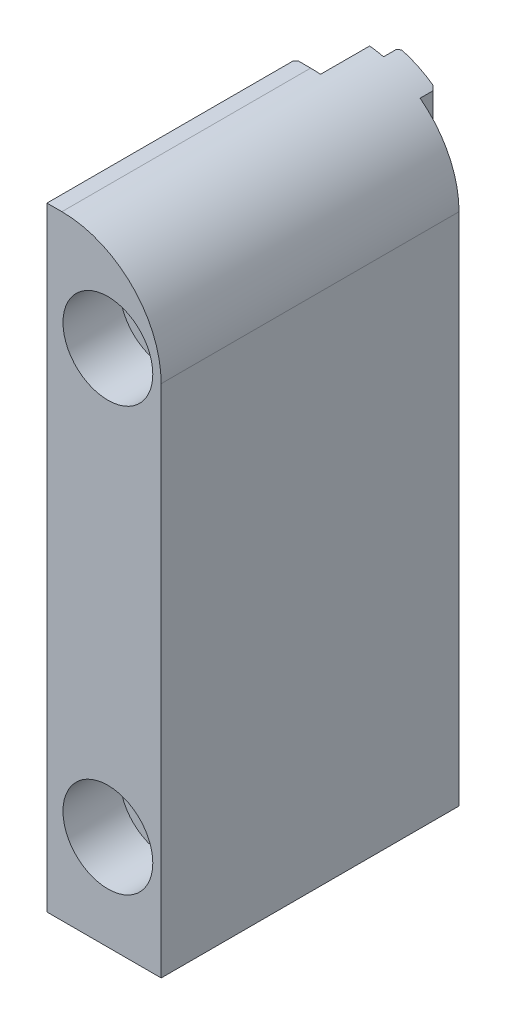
ISO-10303-21;
HEADER;
FILE_DESCRIPTION(('STEP AP214'),'2;1');
FILE_NAME('part.step','',(''),(''),'','','');
FILE_SCHEMA(('AUTOMOTIVE_DESIGN { 1 0 10303 214 1 1 1 1 }'));
ENDSEC;
DATA;
#1=APPLICATION_CONTEXT('core data for automotive mechanical design processes');
#2=APPLICATION_PROTOCOL_DEFINITION('international standard','automotive_design',2000,#1);
#3=PRODUCT_CONTEXT('',#1,'mechanical');
#4=PRODUCT('Part','Part','',(#3));
#5=PRODUCT_RELATED_PRODUCT_CATEGORY('part','',(#4));
#6=PRODUCT_DEFINITION_FORMATION('','',#4);
#7=PRODUCT_DEFINITION_CONTEXT('part definition',#1,'design');
#8=PRODUCT_DEFINITION('design','',#6,#7);
#9=PRODUCT_DEFINITION_SHAPE('','',#8);
#10=(LENGTH_UNIT() NAMED_UNIT(*) SI_UNIT(.MILLI.,.METRE.));
#11=(NAMED_UNIT(*) PLANE_ANGLE_UNIT() SI_UNIT($,.RADIAN.));
#12=(NAMED_UNIT(*) SI_UNIT($,.STERADIAN.) SOLID_ANGLE_UNIT());
#13=UNCERTAINTY_MEASURE_WITH_UNIT(LENGTH_MEASURE(1.E-05),#10,'distance_accuracy_value','');
#14=(GEOMETRIC_REPRESENTATION_CONTEXT(3) GLOBAL_UNCERTAINTY_ASSIGNED_CONTEXT((#13)) GLOBAL_UNIT_ASSIGNED_CONTEXT((#10,
#11,#12)) REPRESENTATION_CONTEXT('',''));
#15=CARTESIAN_POINT('',(0.,0.,0.));
#16=DIRECTION('',(0.,0.,1.));
#17=DIRECTION('',(1.,0.,0.));
#18=AXIS2_PLACEMENT_3D('',#15,#16,#17);
#19=CARTESIAN_POINT('',(7.32028,29.845,-28.956));
#20=DIRECTION('',(0.,0.,-1.));
#21=DIRECTION('',(-1.,0.,0.));
#22=AXIS2_PLACEMENT_3D('',#19,#20,#21);
#23=PLANE('',#22);
#24=CARTESIAN_POINT('',(5.92328,-20.574,-28.956));
#25=DIRECTION('',(0.,0.,1.));
#26=DIRECTION('',(1.,0.,0.));
#27=AXIS2_PLACEMENT_3D('',#24,#25,#26);
#28=CIRCLE('',#27,2.7051);
#29=CARTESIAN_POINT('',(8.62838,-20.574,-28.956));
#30=VERTEX_POINT('',#29);
#31=EDGE_CURVE('E307',#30,#30,#28,.T.);
#32=ORIENTED_EDGE('',*,*,#31,.T.);
#33=EDGE_LOOP('',(#32));
#34=FACE_BOUND('',#33,.T.);
#35=CARTESIAN_POINT('',(5.92328,20.574,-28.956));
#36=DIRECTION('',(0.,0.,1.));
#37=DIRECTION('',(1.,0.,0.));
#38=AXIS2_PLACEMENT_3D('',#35,#36,#37);
#39=CIRCLE('',#38,2.7051);
#40=CARTESIAN_POINT('',(8.62838,20.574,-28.956));
#41=VERTEX_POINT('',#40);
#42=EDGE_CURVE('E518',#41,#41,#39,.T.);
#43=ORIENTED_EDGE('',*,*,#42,.T.);
#44=EDGE_LOOP('',(#43));
#45=FACE_BOUND('',#44,.T.);
#46=DIRECTION('',(-0.999999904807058,0.000436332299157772,0.));
#47=VECTOR('',#46,1.);
#48=CARTESIAN_POINT('',(7.31623449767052,20.5733922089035,-28.956));
#49=LINE('',#48,#47);
#50=CARTESIAN_POINT('',(9.09853369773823,20.5726145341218,-28.956));
#51=VERTEX_POINT('',#50);
#52=CARTESIAN_POINT('',(9.09827969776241,20.5726146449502,-28.956));
#53=VERTEX_POINT('',#52);
#54=EDGE_CURVE('E252',#51,#53,#49,.T.);
#55=ORIENTED_EDGE('',*,*,#54,.T.);
#56=CARTESIAN_POINT('',(5.92328,20.574,-28.956));
#57=DIRECTION('',(0.,0.,-1.));
#58=DIRECTION('',(-1.,0.,0.));
#59=AXIS2_PLACEMENT_3D('',#56,#57,#58);
#60=CIRCLE('',#59,3.175);
#61=CARTESIAN_POINT('',(9.09828,20.574,-28.956));
#62=VERTEX_POINT('',#61);
#63=EDGE_CURVE('E300',#53,#62,#60,.T.);
#64=ORIENTED_EDGE('',*,*,#63,.T.);
#65=DIRECTION('',(-1.,0.,0.));
#66=VECTOR('',#65,1.);
#67=CARTESIAN_POINT('',(7.32028,20.574,-28.956));
#68=LINE('',#67,#66);
#69=CARTESIAN_POINT('',(9.098534,20.574,-28.956));
#70=VERTEX_POINT('',#69);
#71=EDGE_CURVE('E474',#62,#70,#68,.F.);
#72=ORIENTED_EDGE('',*,*,#71,.T.);
#73=CARTESIAN_POINT('',(5.92328,20.574,-28.956));
#74=DIRECTION('',(0.,0.,-1.));
#75=DIRECTION('',(-1.,0.,0.));
#76=AXIS2_PLACEMENT_3D('',#73,#74,#75);
#77=CIRCLE('',#76,3.175254);
#78=CARTESIAN_POINT('',(7.32028,23.4254257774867,-28.956));
#79=VERTEX_POINT('',#78);
#80=EDGE_CURVE('E493',#79,#70,#77,.T.);
#81=ORIENTED_EDGE('',*,*,#80,.F.);
#82=DIRECTION('',(0.,-1.,0.));
#83=VECTOR('',#82,1.);
#84=CARTESIAN_POINT('',(7.32028,29.845,-28.956));
#85=LINE('',#84,#83);
#86=CARTESIAN_POINT('',(7.32028,27.8568581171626,-28.956));
#87=VERTEX_POINT('',#86);
#88=EDGE_CURVE('E275',#87,#79,#85,.T.);
#89=ORIENTED_EDGE('',*,*,#88,.F.);
#90=CARTESIAN_POINT('',(1.45288,20.193,-28.956));
#91=DIRECTION('',(0.,0.,-1.));
#92=DIRECTION('',(-1.,0.,0.));
#93=AXIS2_PLACEMENT_3D('',#90,#91,#92);
#94=CIRCLE('',#93,9.652);
#95=CARTESIAN_POINT('',(11.10488,20.193,-28.956));
#96=VERTEX_POINT('',#95);
#97=EDGE_CURVE('E547',#87,#96,#94,.T.);
#98=ORIENTED_EDGE('',*,*,#97,.T.);
#99=DIRECTION('',(0.,-1.,0.));
#100=VECTOR('',#99,1.);
#101=CARTESIAN_POINT('',(11.10488,29.845,-28.956));
#102=LINE('',#101,#100);
#103=CARTESIAN_POINT('',(11.10488,-29.845,-28.956));
#104=VERTEX_POINT('',#103);
#105=EDGE_CURVE('E278',#96,#104,#102,.T.);
#106=ORIENTED_EDGE('',*,*,#105,.T.);
#107=DIRECTION('',(1.,0.,0.));
#108=VECTOR('',#107,1.);
#109=CARTESIAN_POINT('',(7.32028,-29.845,-28.956));
#110=LINE('',#109,#108);
#111=CARTESIAN_POINT('',(7.32028,-29.845,-28.956));
#112=VERTEX_POINT('',#111);
#113=EDGE_CURVE('E326',#112,#104,#110,.T.);
#114=ORIENTED_EDGE('',*,*,#113,.F.);
#115=CARTESIAN_POINT('',(7.32028,-23.4254257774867,-28.956));
#116=VERTEX_POINT('',#115);
#117=EDGE_CURVE('E276',#116,#112,#85,.T.);
#118=ORIENTED_EDGE('',*,*,#117,.F.);
#119=CARTESIAN_POINT('',(5.92328,-20.574,-28.956));
#120=DIRECTION('',(0.,0.,-1.));
#121=DIRECTION('',(-1.,0.,0.));
#122=AXIS2_PLACEMENT_3D('',#119,#120,#121);
#123=CIRCLE('',#122,3.175254);
#124=CARTESIAN_POINT('',(9.09853369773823,-20.5753854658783,-28.956));
#125=VERTEX_POINT('',#124);
#126=EDGE_CURVE('E442',#125,#116,#123,.T.);
#127=ORIENTED_EDGE('',*,*,#126,.F.);
#128=DIRECTION('',(-0.999999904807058,0.000436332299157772,0.));
#129=VECTOR('',#128,1.);
#130=CARTESIAN_POINT('',(7.29828029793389,-20.5745999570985,-28.956));
#131=LINE('',#130,#129);
#132=CARTESIAN_POINT('',(9.09827969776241,-20.5753853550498,-28.956));
#133=VERTEX_POINT('',#132);
#134=EDGE_CURVE('E440',#125,#133,#131,.T.);
#135=ORIENTED_EDGE('',*,*,#134,.T.);
#136=CARTESIAN_POINT('',(5.92328,-20.574,-28.956));
#137=DIRECTION('',(0.,0.,-1.));
#138=DIRECTION('',(-1.,0.,0.));
#139=AXIS2_PLACEMENT_3D('',#136,#137,#138);
#140=CIRCLE('',#139,3.175);
#141=CARTESIAN_POINT('',(9.09828,-20.574,-28.956));
#142=VERTEX_POINT('',#141);
#143=EDGE_CURVE('E338',#133,#142,#140,.T.);
#144=ORIENTED_EDGE('',*,*,#143,.T.);
#145=DIRECTION('',(-1.,0.,0.));
#146=VECTOR('',#145,1.);
#147=CARTESIAN_POINT('',(7.32028,-20.574,-28.956));
#148=LINE('',#147,#146);
#149=CARTESIAN_POINT('',(9.098534,-20.574,-28.956));
#150=VERTEX_POINT('',#149);
#151=EDGE_CURVE('E439',#142,#150,#148,.F.);
#152=ORIENTED_EDGE('',*,*,#151,.T.);
#153=CARTESIAN_POINT('',(7.32028,-17.7225742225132,-28.956));
#154=VERTEX_POINT('',#153);
#155=EDGE_CURVE('E432',#154,#150,#123,.T.);
#156=ORIENTED_EDGE('',*,*,#155,.F.);
#157=CARTESIAN_POINT('',(7.32028,17.7225742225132,-28.956));
#158=VERTEX_POINT('',#157);
#159=EDGE_CURVE('E19',#158,#154,#85,.T.);
#160=ORIENTED_EDGE('',*,*,#159,.F.);
#161=EDGE_CURVE('E478',#51,#158,#77,.T.);
#162=ORIENTED_EDGE('',*,*,#161,.F.);
#163=EDGE_LOOP('',(#55,#64,#72,#81,#89,#98,#106,#114,#118,#127,#135,#144,#152,#156,#160,#162));
#164=FACE_BOUND('',#163,.T.);
#165=ADVANCED_FACE('F15',(#34,#45,#164),#23,.T.);
#166=CARTESIAN_POINT('',(5.92328,20.574,-18.5166));
#167=DIRECTION('',(0.,0.,1.));
#168=DIRECTION('',(-1.,0.,0.));
#169=AXIS2_PLACEMENT_3D('',#166,#167,#168);
#170=CONICAL_SURFACE('',#169,3.3147,0.785398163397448);
#171=CARTESIAN_POINT('',(5.92328,20.574,-19.1262));
#172=DIRECTION('',(0.,0.,-1.));
#173=DIRECTION('',(-1.,0.,0.));
#174=AXIS2_PLACEMENT_3D('',#171,#172,#173);
#175=CIRCLE('',#174,2.7051);
#176=CARTESIAN_POINT('',(3.21818,20.574,-19.1262));
#177=VERTEX_POINT('',#176);
#178=EDGE_CURVE('E289',#177,#177,#175,.T.);
#179=ORIENTED_EDGE('',*,*,#178,.T.);
#180=EDGE_LOOP('',(#179));
#181=FACE_BOUND('',#180,.T.);
#182=CARTESIAN_POINT('',(5.92328,20.574,-18.5166));
#183=DIRECTION('',(0.,0.,1.));
#184=DIRECTION('',(1.,0.,0.));
#185=AXIS2_PLACEMENT_3D('',#182,#183,#184);
#186=CIRCLE('',#185,3.3147);
#187=CARTESIAN_POINT('',(9.23798,20.574,-18.5166));
#188=VERTEX_POINT('',#187);
#189=EDGE_CURVE('E296',#188,#188,#186,.T.);
#190=ORIENTED_EDGE('',*,*,#189,.T.);
#191=EDGE_LOOP('',(#190));
#192=FACE_BOUND('',#191,.T.);
#193=CARTESIAN_POINT('',(5.92328,20.574,-18.6563));
#194=DIRECTION('',(0.,0.,1.));
#195=DIRECTION('',(1.,0.,0.));
#196=AXIS2_PLACEMENT_3D('',#193,#194,#195);
#197=CIRCLE('',#196,3.175);
#198=CARTESIAN_POINT('',(9.09827969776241,20.5726146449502,-18.6563));
#199=VERTEX_POINT('',#198);
#200=CARTESIAN_POINT('',(9.09828,20.574,-18.6563));
#201=VERTEX_POINT('',#200);
#202=EDGE_CURVE('E9',#199,#201,#197,.F.);
#203=ORIENTED_EDGE('',*,*,#202,.F.);
#204=DIRECTION('',(0.707106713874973,-0.000308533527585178,0.707106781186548));
#205=VECTOR('',#204,1.);
#206=CARTESIAN_POINT('',(5.92328,20.574,-21.8313));
#207=LINE('',#206,#205);
#208=CARTESIAN_POINT('',(9.09853369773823,20.5726145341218,-18.656046));
#209=VERTEX_POINT('',#208);
#210=EDGE_CURVE('E244',#209,#199,#207,.F.);
#211=ORIENTED_EDGE('',*,*,#210,.F.);
#212=CARTESIAN_POINT('',(5.92328,20.574,-18.656046));
#213=DIRECTION('',(0.,0.,1.));
#214=DIRECTION('',(1.,0.,0.));
#215=AXIS2_PLACEMENT_3D('',#212,#213,#214);
#216=CIRCLE('',#215,3.175254);
#217=CARTESIAN_POINT('',(9.098534,20.574,-18.656046));
#218=VERTEX_POINT('',#217);
#219=EDGE_CURVE('E236',#209,#218,#216,.F.);
#220=ORIENTED_EDGE('',*,*,#219,.T.);
#221=DIRECTION('',(0.707106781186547,0.,0.707106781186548));
#222=VECTOR('',#221,1.);
#223=CARTESIAN_POINT('',(5.92328,20.574,-21.8313));
#224=LINE('',#223,#222);
#225=EDGE_CURVE('E25',#201,#218,#224,.T.);
#226=ORIENTED_EDGE('',*,*,#225,.F.);
#227=EDGE_LOOP('',(#203,#211,#220,#226));
#228=FACE_BOUND('',#227,.T.);
#229=ADVANCED_FACE('F255',(#181,#192,#228),#170,.F.);
#230=CARTESIAN_POINT('',(3.76428,18.2457051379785,-28.956));
#231=VERTEX_POINT('',#230);
#232=CARTESIAN_POINT('',(3.76428,22.9022948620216,-28.956));
#233=VERTEX_POINT('',#232);
#234=EDGE_CURVE('E488',#231,#233,#77,.T.);
#235=ORIENTED_EDGE('',*,*,#234,.F.);
#236=DIRECTION('',(0.,-1.,0.));
#237=VECTOR('',#236,1.);
#238=CARTESIAN_POINT('',(3.76428,29.845,-28.956));
#239=LINE('',#238,#237);
#240=CARTESIAN_POINT('',(3.76428,-18.2457051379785,-28.956));
#241=VERTEX_POINT('',#240);
#242=EDGE_CURVE('E259',#231,#241,#239,.T.);
#243=ORIENTED_EDGE('',*,*,#242,.T.);
#244=CARTESIAN_POINT('',(3.76428,-22.9022948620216,-28.956));
#245=VERTEX_POINT('',#244);
#246=EDGE_CURVE('E443',#245,#241,#123,.T.);
#247=ORIENTED_EDGE('',*,*,#246,.F.);
#248=CARTESIAN_POINT('',(3.76428,-29.845,-28.956));
#249=VERTEX_POINT('',#248);
#250=EDGE_CURVE('E262',#245,#249,#239,.T.);
#251=ORIENTED_EDGE('',*,*,#250,.T.);
#252=DIRECTION('',(1.,0.,0.));
#253=VECTOR('',#252,1.);
#254=CARTESIAN_POINT('',(2.34188,-29.845,-28.956));
#255=LINE('',#254,#253);
#256=CARTESIAN_POINT('',(2.40538,-29.845,-28.956));
#257=VERTEX_POINT('',#256);
#258=EDGE_CURVE('E399',#257,#249,#255,.T.);
#259=ORIENTED_EDGE('',*,*,#258,.F.);
#260=DIRECTION('',(0.,-1.,0.));
#261=VECTOR('',#260,1.);
#262=CARTESIAN_POINT('',(2.40538,29.845,-28.956));
#263=LINE('',#262,#261);
#264=CARTESIAN_POINT('',(2.413,29.797127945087,-28.956));
#265=VERTEX_POINT('',#264);
#266=EDGE_CURVE('E383',#265,#257,#263,.T.);
#267=ORIENTED_EDGE('',*,*,#266,.F.);
#268=CARTESIAN_POINT('',(1.45288,20.193,-28.956));
#269=DIRECTION('',(0.,0.,-1.));
#270=DIRECTION('',(-1.,0.,0.));
#271=AXIS2_PLACEMENT_3D('',#268,#269,#270);
#272=CIRCLE('',#271,9.652);
#273=CARTESIAN_POINT('',(3.76428,29.5641543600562,-28.956));
#274=VERTEX_POINT('',#273);
#275=EDGE_CURVE('E391',#265,#274,#272,.T.);
#276=ORIENTED_EDGE('',*,*,#275,.T.);
#277=EDGE_CURVE('E261',#274,#233,#239,.T.);
#278=ORIENTED_EDGE('',*,*,#277,.T.);
#279=EDGE_LOOP('',(#235,#243,#247,#251,#259,#267,#276,#278));
#280=FACE_BOUND('',#279,.T.);
#281=ADVANCED_FACE('F663',(#280),#23,.T.);
#282=CARTESIAN_POINT('',(5.92328,-20.574,-18.5166));
#283=DIRECTION('',(0.,0.,1.));
#284=DIRECTION('',(-1.,0.,0.));
#285=AXIS2_PLACEMENT_3D('',#282,#283,#284);
#286=CONICAL_SURFACE('',#285,3.3147,0.785398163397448);
#287=CARTESIAN_POINT('',(5.92328,-20.574,-19.1262));
#288=DIRECTION('',(0.,0.,-1.));
#289=DIRECTION('',(-1.,0.,0.));
#290=AXIS2_PLACEMENT_3D('',#287,#288,#289);
#291=CIRCLE('',#290,2.7051);
#292=CARTESIAN_POINT('',(3.21818,-20.574,-19.1262));
#293=VERTEX_POINT('',#292);
#294=EDGE_CURVE('E297',#293,#293,#291,.T.);
#295=ORIENTED_EDGE('',*,*,#294,.T.);
#296=EDGE_LOOP('',(#295));
#297=FACE_BOUND('',#296,.T.);
#298=CARTESIAN_POINT('',(5.92328,-20.574,-18.5166));
#299=DIRECTION('',(0.,0.,1.));
#300=DIRECTION('',(1.,0.,0.));
#301=AXIS2_PLACEMENT_3D('',#298,#299,#300);
#302=CIRCLE('',#301,3.3147);
#303=CARTESIAN_POINT('',(9.23798,-20.574,-18.5166));
#304=VERTEX_POINT('',#303);
#305=EDGE_CURVE('E292',#304,#304,#302,.T.);
#306=ORIENTED_EDGE('',*,*,#305,.T.);
#307=EDGE_LOOP('',(#306));
#308=FACE_BOUND('',#307,.T.);
#309=CARTESIAN_POINT('',(5.92328,-20.574,-18.6563));
#310=DIRECTION('',(0.,0.,1.));
#311=DIRECTION('',(1.,0.,0.));
#312=AXIS2_PLACEMENT_3D('',#309,#310,#311);
#313=CIRCLE('',#312,3.175);
#314=CARTESIAN_POINT('',(9.09827969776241,-20.5753853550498,-18.6563));
#315=VERTEX_POINT('',#314);
#316=CARTESIAN_POINT('',(9.09828,-20.574,-18.6563));
#317=VERTEX_POINT('',#316);
#318=EDGE_CURVE('E245',#315,#317,#313,.F.);
#319=ORIENTED_EDGE('',*,*,#318,.F.);
#320=DIRECTION('',(0.707106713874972,-0.000308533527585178,0.707106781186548));
#321=VECTOR('',#320,1.);
#322=CARTESIAN_POINT('',(5.92328,-20.574,-21.8313));
#323=LINE('',#322,#321);
#324=CARTESIAN_POINT('',(9.09853369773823,-20.5753854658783,-18.656046));
#325=VERTEX_POINT('',#324);
#326=EDGE_CURVE('E283',#325,#315,#323,.F.);
#327=ORIENTED_EDGE('',*,*,#326,.F.);
#328=CARTESIAN_POINT('',(5.92328,-20.574,-18.656046));
#329=DIRECTION('',(0.,0.,1.));
#330=DIRECTION('',(1.,0.,0.));
#331=AXIS2_PLACEMENT_3D('',#328,#329,#330);
#332=CIRCLE('',#331,3.175254);
#333=CARTESIAN_POINT('',(9.098534,-20.574,-18.656046));
#334=VERTEX_POINT('',#333);
#335=EDGE_CURVE('E285',#325,#334,#332,.F.);
#336=ORIENTED_EDGE('',*,*,#335,.T.);
#337=DIRECTION('',(0.707106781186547,0.,0.707106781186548));
#338=VECTOR('',#337,1.);
#339=CARTESIAN_POINT('',(5.92328,-20.574,-21.8313));
#340=LINE('',#339,#338);
#341=EDGE_CURVE('E280',#317,#334,#340,.T.);
#342=ORIENTED_EDGE('',*,*,#341,.F.);
#343=EDGE_LOOP('',(#319,#327,#336,#342));
#344=FACE_BOUND('',#343,.T.);
#345=ADVANCED_FACE('F597',(#297,#308,#344),#286,.F.);
#346=CARTESIAN_POINT('',(3.76428,29.845,-28.956));
#347=DIRECTION('',(-1.,0.,0.));
#348=DIRECTION('',(0.,0.,1.));
#349=AXIS2_PLACEMENT_3D('',#346,#347,#348);
#350=PLANE('',#349);
#351=DIRECTION('',(0.,0.,1.));
#352=VECTOR('',#351,1.);
#353=CARTESIAN_POINT('',(3.76428,-22.9022948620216,-18.5166));
#354=LINE('',#353,#352);
#355=CARTESIAN_POINT('',(3.76428,-22.9022948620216,-30.226));
#356=VERTEX_POINT('',#355);
#357=EDGE_CURVE('E451',#356,#245,#354,.T.);
#358=ORIENTED_EDGE('',*,*,#357,.F.);
#359=DIRECTION('',(0.,1.,0.));
#360=VECTOR('',#359,1.);
#361=CARTESIAN_POINT('',(3.76428,29.845,-30.226));
#362=LINE('',#361,#360);
#363=CARTESIAN_POINT('',(3.76428,-29.845,-30.226));
#364=VERTEX_POINT('',#363);
#365=EDGE_CURVE('E350',#364,#356,#362,.T.);
#366=ORIENTED_EDGE('',*,*,#365,.F.);
#367=DIRECTION('',(0.,0.,-1.));
#368=VECTOR('',#367,1.);
#369=CARTESIAN_POINT('',(3.76428,-29.845,-28.956));
#370=LINE('',#369,#368);
#371=EDGE_CURVE('E525',#249,#364,#370,.T.);
#372=ORIENTED_EDGE('',*,*,#371,.F.);
#373=ORIENTED_EDGE('',*,*,#250,.F.);
#374=EDGE_LOOP('',(#358,#366,#372,#373));
#375=FACE_BOUND('',#374,.T.);
#376=ADVANCED_FACE('F666',(#375),#350,.T.);
#377=CARTESIAN_POINT('',(7.32028,29.845,-30.226));
#378=DIRECTION('',(-0.707106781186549,0.,0.707106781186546));
#379=DIRECTION('',(-0.707106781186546,0.,-0.707106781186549));
#380=AXIS2_PLACEMENT_3D('',#377,#378,#379);
#381=PLANE('',#380);
#382=CARTESIAN_POINT('',(5.92328,-20.574,-31.623));
#383=DIRECTION('',(-0.707106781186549,0.,0.707106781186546));
#384=DIRECTION('',(0.707106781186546,0.,0.707106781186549));
#385=AXIS2_PLACEMENT_3D('',#382,#383,#384);
#386=ELLIPSE('',#385,4.49048727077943,3.175254);
#387=CARTESIAN_POINT('',(7.32028,-23.4254257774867,-30.226));
#388=VERTEX_POINT('',#387);
#389=CARTESIAN_POINT('',(7.06628,-23.5363958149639,-30.48));
#390=VERTEX_POINT('',#389);
#391=EDGE_CURVE('E455',#388,#390,#386,.F.);
#392=ORIENTED_EDGE('',*,*,#391,.F.);
#393=DIRECTION('',(0.,-1.,0.));
#394=VECTOR('',#393,1.);
#395=CARTESIAN_POINT('',(7.32028,29.845,-30.226));
#396=LINE('',#395,#394);
#397=CARTESIAN_POINT('',(7.32028,-29.845,-30.226));
#398=VERTEX_POINT('',#397);
#399=EDGE_CURVE('E380',#388,#398,#396,.T.);
#400=ORIENTED_EDGE('',*,*,#399,.T.);
#401=DIRECTION('',(0.707106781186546,0.,0.707106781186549));
#402=VECTOR('',#401,1.);
#403=CARTESIAN_POINT('',(7.32028,-29.845,-30.226));
#404=LINE('',#403,#402);
#405=CARTESIAN_POINT('',(7.06628,-29.845,-30.48));
#406=VERTEX_POINT('',#405);
#407=EDGE_CURVE('E369',#398,#406,#404,.F.);
#408=ORIENTED_EDGE('',*,*,#407,.T.);
#409=DIRECTION('',(0.,1.,0.));
#410=VECTOR('',#409,1.);
#411=CARTESIAN_POINT('',(7.06628,29.845,-30.48));
#412=LINE('',#411,#410);
#413=EDGE_CURVE('E359',#406,#390,#412,.T.);
#414=ORIENTED_EDGE('',*,*,#413,.T.);
#415=EDGE_LOOP('',(#392,#400,#408,#414));
#416=FACE_BOUND('',#415,.T.);
#417=ADVANCED_FACE('F582',(#416),#381,.F.);
#418=CARTESIAN_POINT('',(3.76428,29.845,-30.48));
#419=DIRECTION('',(0.,0.,-1.));
#420=DIRECTION('',(-1.,0.,0.));
#421=AXIS2_PLACEMENT_3D('',#418,#419,#420);
#422=PLANE('',#421);
#423=CARTESIAN_POINT('',(5.92328,20.574,-30.48));
#424=DIRECTION('',(0.,0.,-1.));
#425=DIRECTION('',(-1.,0.,0.));
#426=AXIS2_PLACEMENT_3D('',#423,#424,#425);
#427=CIRCLE('',#426,3.175254);
#428=CARTESIAN_POINT('',(7.06628,17.6116041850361,-30.48));
#429=VERTEX_POINT('',#428);
#430=CARTESIAN_POINT('',(4.01828,18.0336825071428,-30.48));
#431=VERTEX_POINT('',#430);
#432=EDGE_CURVE('E482',#429,#431,#427,.T.);
#433=ORIENTED_EDGE('',*,*,#432,.F.);
#434=CARTESIAN_POINT('',(7.06628,-17.6116041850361,-30.48));
#435=VERTEX_POINT('',#434);
#436=EDGE_CURVE('E362',#435,#429,#412,.T.);
#437=ORIENTED_EDGE('',*,*,#436,.F.);
#438=CARTESIAN_POINT('',(5.92328,-20.574,-30.48));
#439=DIRECTION('',(0.,0.,-1.));
#440=DIRECTION('',(-1.,0.,0.));
#441=AXIS2_PLACEMENT_3D('',#438,#439,#440);
#442=CIRCLE('',#441,3.175254);
#443=CARTESIAN_POINT('',(4.01828,-18.0336825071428,-30.48));
#444=VERTEX_POINT('',#443);
#445=EDGE_CURVE('E448',#444,#435,#442,.T.);
#446=ORIENTED_EDGE('',*,*,#445,.F.);
#447=DIRECTION('',(0.,-1.,0.));
#448=VECTOR('',#447,1.);
#449=CARTESIAN_POINT('',(4.01828,29.845,-30.48));
#450=LINE('',#449,#448);
#451=EDGE_CURVE('E367',#431,#444,#450,.T.);
#452=ORIENTED_EDGE('',*,*,#451,.F.);
#453=EDGE_LOOP('',(#433,#437,#446,#452));
#454=FACE_BOUND('',#453,.T.);
#455=ADVANCED_FACE('F562',(#454),#422,.T.);
#456=CARTESIAN_POINT('',(7.32028,29.845,-30.48));
#457=DIRECTION('',(1.,0.,0.));
#458=DIRECTION('',(0.,0.,-1.));
#459=AXIS2_PLACEMENT_3D('',#456,#457,#458);
#460=PLANE('',#459);
#461=DIRECTION('',(0.,0.,1.));
#462=VECTOR('',#461,1.);
#463=CARTESIAN_POINT('',(7.32028,17.7225742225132,-18.5166));
#464=LINE('',#463,#462);
#465=CARTESIAN_POINT('',(7.32028,17.7225742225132,-30.226));
#466=VERTEX_POINT('',#465);
#467=EDGE_CURVE('E426',#158,#466,#464,.F.);
#468=ORIENTED_EDGE('',*,*,#467,.F.);
#469=ORIENTED_EDGE('',*,*,#159,.T.);
#470=DIRECTION('',(0.,0.,1.));
#471=VECTOR('',#470,1.);
#472=CARTESIAN_POINT('',(7.32028,-17.7225742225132,-18.5166));
#473=LINE('',#472,#471);
#474=CARTESIAN_POINT('',(7.32028,-17.7225742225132,-30.226));
#475=VERTEX_POINT('',#474);
#476=EDGE_CURVE('E425',#475,#154,#473,.T.);
#477=ORIENTED_EDGE('',*,*,#476,.F.);
#478=EDGE_CURVE('E379',#466,#475,#396,.T.);
#479=ORIENTED_EDGE('',*,*,#478,.F.);
#480=EDGE_LOOP('',(#468,#469,#477,#479));
#481=FACE_BOUND('',#480,.T.);
#482=ADVANCED_FACE('F423',(#481),#460,.T.);
#483=CARTESIAN_POINT('',(4.01828,29.845,-30.48));
#484=DIRECTION('',(0.707106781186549,0.,0.707106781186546));
#485=DIRECTION('',(-0.707106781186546,0.,0.707106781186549));
#486=AXIS2_PLACEMENT_3D('',#483,#484,#485);
#487=PLANE('',#486);
#488=CARTESIAN_POINT('',(5.92328,20.574,-32.385));
#489=DIRECTION('',(0.707106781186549,0.,0.707106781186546));
#490=DIRECTION('',(-0.707106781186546,0.,0.707106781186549));
#491=AXIS2_PLACEMENT_3D('',#488,#489,#490);
#492=ELLIPSE('',#491,4.49048727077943,3.175254);
#493=CARTESIAN_POINT('',(3.76428,18.2457051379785,-30.226));
#494=VERTEX_POINT('',#493);
#495=EDGE_CURVE('E484',#431,#494,#492,.F.);
#496=ORIENTED_EDGE('',*,*,#495,.F.);
#497=ORIENTED_EDGE('',*,*,#451,.T.);
#498=CARTESIAN_POINT('',(5.92328,-20.574,-32.385));
#499=DIRECTION('',(0.707106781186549,0.,0.707106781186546));
#500=DIRECTION('',(-0.707106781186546,0.,0.707106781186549));
#501=AXIS2_PLACEMENT_3D('',#498,#499,#500);
#502=ELLIPSE('',#501,4.49048727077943,3.175254);
#503=CARTESIAN_POINT('',(3.76428,-18.2457051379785,-30.226));
#504=VERTEX_POINT('',#503);
#505=EDGE_CURVE('E609',#504,#444,#502,.F.);
#506=ORIENTED_EDGE('',*,*,#505,.F.);
#507=EDGE_CURVE('E353',#504,#494,#362,.T.);
#508=ORIENTED_EDGE('',*,*,#507,.T.);
#509=EDGE_LOOP('',(#496,#497,#506,#508));
#510=FACE_BOUND('',#509,.T.);
#511=ADVANCED_FACE('F615',(#510),#487,.F.);
#512=DIRECTION('',(0.,0.,1.));
#513=VECTOR('',#512,1.);
#514=CARTESIAN_POINT('',(3.76428,18.2457051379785,-18.5166));
#515=LINE('',#514,#513);
#516=EDGE_CURVE('E486',#494,#231,#515,.T.);
#517=ORIENTED_EDGE('',*,*,#516,.F.);
#518=ORIENTED_EDGE('',*,*,#507,.F.);
#519=DIRECTION('',(0.,0.,1.));
#520=VECTOR('',#519,1.);
#521=CARTESIAN_POINT('',(3.76428,-18.2457051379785,-18.5166));
#522=LINE('',#521,#520);
#523=EDGE_CURVE('E454',#241,#504,#522,.F.);
#524=ORIENTED_EDGE('',*,*,#523,.F.);
#525=ORIENTED_EDGE('',*,*,#242,.F.);
#526=EDGE_LOOP('',(#517,#518,#524,#525));
#527=FACE_BOUND('',#526,.T.);
#528=ADVANCED_FACE('F617',(#527),#350,.T.);
#529=CARTESIAN_POINT('',(5.92328,20.574,-30.48));
#530=DIRECTION('',(0.,0.,-1.));
#531=DIRECTION('',(-1.,0.,0.));
#532=AXIS2_PLACEMENT_3D('',#529,#530,#531);
#533=CIRCLE('',#532,3.175254);
#534=CARTESIAN_POINT('',(4.01828,23.1143174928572,-30.48));
#535=VERTEX_POINT('',#534);
#536=CARTESIAN_POINT('',(7.06628,23.5363958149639,-30.48));
#537=VERTEX_POINT('',#536);
#538=EDGE_CURVE('E33',#535,#537,#533,.T.);
#539=ORIENTED_EDGE('',*,*,#538,.F.);
#540=CARTESIAN_POINT('',(4.01828,29.4978281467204,-30.48));
#541=VERTEX_POINT('',#540);
#542=EDGE_CURVE('E364',#541,#535,#450,.T.);
#543=ORIENTED_EDGE('',*,*,#542,.F.);
#544=CARTESIAN_POINT('',(1.45288,20.193,-30.48));
#545=DIRECTION('',(0.,0.,-1.));
#546=DIRECTION('',(-1.,0.,0.));
#547=AXIS2_PLACEMENT_3D('',#544,#545,#546);
#548=CIRCLE('',#547,9.652);
#549=CARTESIAN_POINT('',(7.06628,28.0448051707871,-30.48));
#550=VERTEX_POINT('',#549);
#551=EDGE_CURVE('E543',#541,#550,#548,.T.);
#552=ORIENTED_EDGE('',*,*,#551,.T.);
#553=EDGE_CURVE('E363',#537,#550,#412,.T.);
#554=ORIENTED_EDGE('',*,*,#553,.F.);
#555=EDGE_LOOP('',(#539,#543,#552,#554));
#556=FACE_BOUND('',#555,.T.);
#557=ADVANCED_FACE('F637',(#556),#422,.T.);
#558=DIRECTION('',(0.,0.,1.));
#559=VECTOR('',#558,1.);
#560=CARTESIAN_POINT('',(7.32028,23.4254257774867,-18.5166));
#561=LINE('',#560,#559);
#562=CARTESIAN_POINT('',(7.32028,23.4254257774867,-30.226));
#563=VERTEX_POINT('',#562);
#564=EDGE_CURVE('E496',#563,#79,#561,.T.);
#565=ORIENTED_EDGE('',*,*,#564,.F.);
#566=CARTESIAN_POINT('',(7.32028,27.8568581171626,-30.226));
#567=VERTEX_POINT('',#566);
#568=EDGE_CURVE('E376',#567,#563,#396,.T.);
#569=ORIENTED_EDGE('',*,*,#568,.F.);
#570=DIRECTION('',(0.,0.,1.));
#571=VECTOR('',#570,1.);
#572=CARTESIAN_POINT('',(7.32028,27.8568581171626,-30.48));
#573=LINE('',#572,#571);
#574=EDGE_CURVE('E546',#567,#87,#573,.T.);
#575=ORIENTED_EDGE('',*,*,#574,.T.);
#576=ORIENTED_EDGE('',*,*,#88,.T.);
#577=EDGE_LOOP('',(#565,#569,#575,#576));
#578=FACE_BOUND('',#577,.T.);
#579=ADVANCED_FACE('F641',(#578),#460,.T.);
#580=CARTESIAN_POINT('',(5.92328,20.574,-31.623));
#581=DIRECTION('',(-0.707106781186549,0.,0.707106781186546));
#582=DIRECTION('',(0.707106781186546,0.,0.707106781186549));
#583=AXIS2_PLACEMENT_3D('',#580,#581,#582);
#584=ELLIPSE('',#583,4.49048727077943,3.175254);
#585=EDGE_CURVE('E480',#466,#429,#584,.F.);
#586=ORIENTED_EDGE('',*,*,#585,.F.);
#587=ORIENTED_EDGE('',*,*,#478,.T.);
#588=CARTESIAN_POINT('',(5.92328,-20.574,-31.623));
#589=DIRECTION('',(-0.707106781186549,0.,0.707106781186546));
#590=DIRECTION('',(0.707106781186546,0.,0.707106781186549));
#591=AXIS2_PLACEMENT_3D('',#588,#589,#590);
#592=ELLIPSE('',#591,4.49048727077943,3.175254);
#593=EDGE_CURVE('E435',#435,#475,#592,.F.);
#594=ORIENTED_EDGE('',*,*,#593,.F.);
#595=ORIENTED_EDGE('',*,*,#436,.T.);
#596=EDGE_LOOP('',(#586,#587,#594,#595));
#597=FACE_BOUND('',#596,.T.);
#598=ADVANCED_FACE('F555',(#597),#381,.F.);
#599=CARTESIAN_POINT('',(5.92328,20.574,-32.385));
#600=DIRECTION('',(0.707106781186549,0.,0.707106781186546));
#601=DIRECTION('',(-0.707106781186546,0.,0.707106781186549));
#602=AXIS2_PLACEMENT_3D('',#599,#600,#601);
#603=ELLIPSE('',#602,4.49048727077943,3.175254);
#604=CARTESIAN_POINT('',(3.76428,22.9022948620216,-30.226));
#605=VERTEX_POINT('',#604);
#606=EDGE_CURVE('E491',#605,#535,#603,.F.);
#607=ORIENTED_EDGE('',*,*,#606,.F.);
#608=CARTESIAN_POINT('',(3.76428,29.5641543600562,-30.226));
#609=VERTEX_POINT('',#608);
#610=EDGE_CURVE('E354',#605,#609,#362,.T.);
#611=ORIENTED_EDGE('',*,*,#610,.T.);
#612=CARTESIAN_POINT('',(1.45288,20.193,-27.9146));
#613=DIRECTION('',(-0.707106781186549,0.,-0.707106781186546));
#614=DIRECTION('',(-0.707106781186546,0.,0.707106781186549));
#615=AXIS2_PLACEMENT_3D('',#612,#613,#614);
#616=ELLIPSE('',#615,13.6499893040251,9.652);
#617=EDGE_CURVE('E357',#609,#541,#616,.T.);
#618=ORIENTED_EDGE('',*,*,#617,.T.);
#619=ORIENTED_EDGE('',*,*,#542,.T.);
#620=EDGE_LOOP('',(#607,#611,#618,#619));
#621=FACE_BOUND('',#620,.T.);
#622=ADVANCED_FACE('F621',(#621),#487,.F.);
#623=CARTESIAN_POINT('',(11.10488,29.845,-28.956));
#624=DIRECTION('',(1.,0.,0.));
#625=DIRECTION('',(0.,0.,-1.));
#626=AXIS2_PLACEMENT_3D('',#623,#624,#625);
#627=PLANE('',#626);
#628=ORIENTED_EDGE('',*,*,#105,.F.);
#629=DIRECTION('',(0.,0.,1.));
#630=VECTOR('',#629,1.);
#631=CARTESIAN_POINT('',(11.10488,20.193,-28.956));
#632=LINE('',#631,#630);
#633=CARTESIAN_POINT('',(11.10488,20.193,0.));
#634=VERTEX_POINT('',#633);
#635=EDGE_CURVE('E331',#96,#634,#632,.T.);
#636=ORIENTED_EDGE('',*,*,#635,.T.);
#637=DIRECTION('',(0.,-1.,0.));
#638=VECTOR('',#637,1.);
#639=CARTESIAN_POINT('',(11.10488,29.845,0.));
#640=LINE('',#639,#638);
#641=CARTESIAN_POINT('',(11.10488,-29.845,0.));
#642=VERTEX_POINT('',#641);
#643=EDGE_CURVE('E320',#634,#642,#640,.T.);
#644=ORIENTED_EDGE('',*,*,#643,.T.);
#645=DIRECTION('',(0.,0.,1.));
#646=VECTOR('',#645,1.);
#647=CARTESIAN_POINT('',(11.10488,-29.845,-28.956));
#648=LINE('',#647,#646);
#649=EDGE_CURVE('E267',#104,#642,#648,.T.);
#650=ORIENTED_EDGE('',*,*,#649,.F.);
#651=EDGE_LOOP('',(#628,#636,#644,#650));
#652=FACE_BOUND('',#651,.T.);
#653=ADVANCED_FACE('F644',(#652),#627,.T.);
#654=CARTESIAN_POINT('',(11.07948,29.845,0.));
#655=DIRECTION('',(0.,0.,1.));
#656=DIRECTION('',(1.,0.,0.));
#657=AXIS2_PLACEMENT_3D('',#654,#655,#656);
#658=PLANE('',#657);
#659=CARTESIAN_POINT('',(5.92328,-20.574,0.));
#660=DIRECTION('',(0.,0.,-1.));
#661=DIRECTION('',(-1.,0.,0.));
#662=AXIS2_PLACEMENT_3D('',#659,#660,#661);
#663=CIRCLE('',#662,4.365625);
#664=CARTESIAN_POINT('',(1.557655,-20.574,0.));
#665=VERTEX_POINT('',#664);
#666=EDGE_CURVE('E312',#665,#665,#663,.F.);
#667=ORIENTED_EDGE('',*,*,#666,.F.);
#668=EDGE_LOOP('',(#667));
#669=FACE_BOUND('',#668,.T.);
#670=CARTESIAN_POINT('',(5.92328,20.574,0.));
#671=DIRECTION('',(0.,0.,-1.));
#672=DIRECTION('',(-1.,0.,0.));
#673=AXIS2_PLACEMENT_3D('',#670,#671,#672);
#674=CIRCLE('',#673,4.365625);
#675=CARTESIAN_POINT('',(1.557655,20.574,0.));
#676=VERTEX_POINT('',#675);
#677=EDGE_CURVE('E308',#676,#676,#674,.F.);
#678=ORIENTED_EDGE('',*,*,#677,.F.);
#679=EDGE_LOOP('',(#678));
#680=FACE_BOUND('',#679,.T.);
#681=ORIENTED_EDGE('',*,*,#643,.F.);
#682=CARTESIAN_POINT('',(1.45288,20.193,0.));
#683=DIRECTION('',(0.,0.,-1.));
#684=DIRECTION('',(-1.,0.,0.));
#685=AXIS2_PLACEMENT_3D('',#682,#683,#684);
#686=CIRCLE('',#685,9.652);
#687=CARTESIAN_POINT('',(1.45288,29.845,0.));
#688=VERTEX_POINT('',#687);
#689=EDGE_CURVE('E327',#634,#688,#686,.F.);
#690=ORIENTED_EDGE('',*,*,#689,.T.);
#691=DIRECTION('',(-1.,0.,0.));
#692=VECTOR('',#691,1.);
#693=CARTESIAN_POINT('',(11.07948,29.845,0.));
#694=LINE('',#693,#692);
#695=CARTESIAN_POINT('',(0.,29.845,0.));
#696=VERTEX_POINT('',#695);
#697=EDGE_CURVE('E322',#688,#696,#694,.T.);
#698=ORIENTED_EDGE('',*,*,#697,.T.);
#699=DIRECTION('',(0.,-1.,0.));
#700=VECTOR('',#699,1.);
#701=CARTESIAN_POINT('',(0.,29.845,0.));
#702=LINE('',#701,#700);
#703=CARTESIAN_POINT('',(0.,-29.845,0.));
#704=VERTEX_POINT('',#703);
#705=EDGE_CURVE('E317',#696,#704,#702,.T.);
#706=ORIENTED_EDGE('',*,*,#705,.T.);
#707=DIRECTION('',(-1.,0.,0.));
#708=VECTOR('',#707,1.);
#709=CARTESIAN_POINT('',(11.07948,-29.845,0.));
#710=LINE('',#709,#708);
#711=EDGE_CURVE('E313',#642,#704,#710,.T.);
#712=ORIENTED_EDGE('',*,*,#711,.F.);
#713=EDGE_LOOP('',(#681,#690,#698,#706,#712));
#714=FACE_BOUND('',#713,.T.);
#715=ADVANCED_FACE('F647',(#669,#680,#714),#658,.T.);
#716=CARTESIAN_POINT('',(0.,29.845,-12.7));
#717=DIRECTION('',(-1.,0.,0.));
#718=DIRECTION('',(0.,0.,1.));
#719=AXIS2_PLACEMENT_3D('',#716,#717,#718);
#720=PLANE('',#719);
#721=DIRECTION('',(0.,0.,-1.));
#722=VECTOR('',#721,1.);
#723=CARTESIAN_POINT('',(0.,-29.845,-24.1808));
#724=LINE('',#723,#722);
#725=CARTESIAN_POINT('',(0.,-29.845,-23.9268));
#726=VERTEX_POINT('',#725);
#727=EDGE_CURVE('E316',#704,#726,#724,.T.);
#728=ORIENTED_EDGE('',*,*,#727,.F.);
#729=ORIENTED_EDGE('',*,*,#705,.F.);
#730=DIRECTION('',(0.,0.,-1.));
#731=VECTOR('',#730,1.);
#732=CARTESIAN_POINT('',(0.,29.845,-24.1808));
#733=LINE('',#732,#731);
#734=CARTESIAN_POINT('',(0.,29.845,-23.9268));
#735=VERTEX_POINT('',#734);
#736=EDGE_CURVE('E325',#696,#735,#733,.T.);
#737=ORIENTED_EDGE('',*,*,#736,.T.);
#738=DIRECTION('',(0.,1.,0.));
#739=VECTOR('',#738,1.);
#740=CARTESIAN_POINT('',(0.,29.845,-23.9268));
#741=LINE('',#740,#739);
#742=EDGE_CURVE('E344',#726,#735,#741,.T.);
#743=ORIENTED_EDGE('',*,*,#742,.F.);
#744=EDGE_LOOP('',(#728,#729,#737,#743));
#745=FACE_BOUND('',#744,.T.);
#746=ADVANCED_FACE('F650',(#745),#720,.T.);
#747=CARTESIAN_POINT('',(-0.00380999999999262,29.845,-24.1808));
#748=DIRECTION('',(0.,0.,-1.));
#749=DIRECTION('',(-1.,0.,0.));
#750=AXIS2_PLACEMENT_3D('',#747,#748,#749);
#751=PLANE('',#750);
#752=DIRECTION('',(1.,0.,0.));
#753=VECTOR('',#752,1.);
#754=CARTESIAN_POINT('',(-0.00380999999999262,29.845,-24.1808));
#755=LINE('',#754,#753);
#756=CARTESIAN_POINT('',(0.254000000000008,29.845,-24.1808));
#757=VERTEX_POINT('',#756);
#758=CARTESIAN_POINT('',(1.45288,29.845,-24.1808));
#759=VERTEX_POINT('',#758);
#760=EDGE_CURVE('E411',#757,#759,#755,.T.);
#761=ORIENTED_EDGE('',*,*,#760,.T.);
#762=CARTESIAN_POINT('',(1.45288,20.193,-24.1808));
#763=DIRECTION('',(0.,0.,-1.));
#764=DIRECTION('',(-1.,0.,0.));
#765=AXIS2_PLACEMENT_3D('',#762,#763,#764);
#766=CIRCLE('',#765,9.652);
#767=CARTESIAN_POINT('',(2.40538,29.797127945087,-24.1808));
#768=VERTEX_POINT('',#767);
#769=EDGE_CURVE('E340',#759,#768,#766,.T.);
#770=ORIENTED_EDGE('',*,*,#769,.T.);
#771=DIRECTION('',(0.,-1.,0.));
#772=VECTOR('',#771,1.);
#773=CARTESIAN_POINT('',(2.40538,29.845,-24.1808));
#774=LINE('',#773,#772);
#775=CARTESIAN_POINT('',(2.40538,-29.845,-24.1808));
#776=VERTEX_POINT('',#775);
#777=EDGE_CURVE('E321',#768,#776,#774,.T.);
#778=ORIENTED_EDGE('',*,*,#777,.T.);
#779=DIRECTION('',(1.,0.,0.));
#780=VECTOR('',#779,1.);
#781=CARTESIAN_POINT('',(-0.00380999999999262,-29.845,-24.1808));
#782=LINE('',#781,#780);
#783=CARTESIAN_POINT('',(0.254000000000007,-29.845,-24.1808));
#784=VERTEX_POINT('',#783);
#785=EDGE_CURVE('E400',#784,#776,#782,.T.);
#786=ORIENTED_EDGE('',*,*,#785,.F.);
#787=DIRECTION('',(0.,-1.,0.));
#788=VECTOR('',#787,1.);
#789=CARTESIAN_POINT('',(0.254000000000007,29.845,-24.1808));
#790=LINE('',#789,#788);
#791=EDGE_CURVE('E347',#757,#784,#790,.T.);
#792=ORIENTED_EDGE('',*,*,#791,.F.);
#793=EDGE_LOOP('',(#761,#770,#778,#786,#792));
#794=FACE_BOUND('',#793,.T.);
#795=ADVANCED_FACE('F656',(#794),#751,.T.);
#796=CARTESIAN_POINT('',(2.40538,29.845,-24.1808));
#797=DIRECTION('',(-1.,0.,0.));
#798=DIRECTION('',(0.,0.,1.));
#799=AXIS2_PLACEMENT_3D('',#796,#797,#798);
#800=PLANE('',#799);
#801=DIRECTION('',(0.,0.,-1.));
#802=VECTOR('',#801,1.);
#803=CARTESIAN_POINT('',(2.40538,-29.845,-24.1808));
#804=LINE('',#803,#802);
#805=EDGE_CURVE('E396',#776,#257,#804,.T.);
#806=ORIENTED_EDGE('',*,*,#805,.F.);
#807=ORIENTED_EDGE('',*,*,#777,.F.);
#808=DIRECTION('',(0.,0.,1.));
#809=VECTOR('',#808,1.);
#810=CARTESIAN_POINT('',(2.40538,29.7978866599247,-24.1808));
#811=LINE('',#810,#809);
#812=EDGE_CURVE('E388',#768,#265,#811,.F.);
#813=ORIENTED_EDGE('',*,*,#812,.T.);
#814=ORIENTED_EDGE('',*,*,#266,.T.);
#815=EDGE_LOOP('',(#806,#807,#813,#814));
#816=FACE_BOUND('',#815,.T.);
#817=ADVANCED_FACE('F659',(#816),#800,.T.);
#818=DIRECTION('',(0.,0.,1.));
#819=VECTOR('',#818,1.);
#820=CARTESIAN_POINT('',(3.76428,22.9022948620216,-18.5166));
#821=LINE('',#820,#819);
#822=EDGE_CURVE('E489',#233,#605,#821,.F.);
#823=ORIENTED_EDGE('',*,*,#822,.F.);
#824=ORIENTED_EDGE('',*,*,#277,.F.);
#825=DIRECTION('',(0.,0.,1.));
#826=VECTOR('',#825,1.);
#827=CARTESIAN_POINT('',(3.76428,29.5641543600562,-28.956));
#828=LINE('',#827,#826);
#829=EDGE_CURVE('E404',#274,#609,#828,.F.);
#830=ORIENTED_EDGE('',*,*,#829,.T.);
#831=ORIENTED_EDGE('',*,*,#610,.F.);
#832=EDGE_LOOP('',(#823,#824,#830,#831));
#833=FACE_BOUND('',#832,.T.);
#834=ADVANCED_FACE('F628',(#833),#350,.T.);
#835=CARTESIAN_POINT('',(5.92328,-20.574,-30.48));
#836=DIRECTION('',(0.,0.,-1.));
#837=DIRECTION('',(-1.,0.,0.));
#838=AXIS2_PLACEMENT_3D('',#835,#836,#837);
#839=CIRCLE('',#838,3.175254);
#840=CARTESIAN_POINT('',(4.01828,-23.1143174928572,-30.48));
#841=VERTEX_POINT('',#840);
#842=EDGE_CURVE('E457',#390,#841,#839,.T.);
#843=ORIENTED_EDGE('',*,*,#842,.F.);
#844=ORIENTED_EDGE('',*,*,#413,.F.);
#845=DIRECTION('',(1.,0.,0.));
#846=VECTOR('',#845,1.);
#847=CARTESIAN_POINT('',(3.76428,-29.845,-30.48));
#848=LINE('',#847,#846);
#849=CARTESIAN_POINT('',(4.01828,-29.845,-30.48));
#850=VERTEX_POINT('',#849);
#851=EDGE_CURVE('E528',#850,#406,#848,.T.);
#852=ORIENTED_EDGE('',*,*,#851,.F.);
#853=EDGE_CURVE('E368',#841,#850,#450,.T.);
#854=ORIENTED_EDGE('',*,*,#853,.F.);
#855=EDGE_LOOP('',(#843,#844,#852,#854));
#856=FACE_BOUND('',#855,.T.);
#857=ADVANCED_FACE('F581',(#856),#422,.T.);
#858=DIRECTION('',(0.,0.,1.));
#859=VECTOR('',#858,1.);
#860=CARTESIAN_POINT('',(7.32028,-23.4254257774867,-18.5166));
#861=LINE('',#860,#859);
#862=EDGE_CURVE('E450',#116,#388,#861,.F.);
#863=ORIENTED_EDGE('',*,*,#862,.F.);
#864=ORIENTED_EDGE('',*,*,#117,.T.);
#865=DIRECTION('',(0.,0.,1.));
#866=VECTOR('',#865,1.);
#867=CARTESIAN_POINT('',(7.32028,-29.845,-30.48));
#868=LINE('',#867,#866);
#869=EDGE_CURVE('E530',#398,#112,#868,.T.);
#870=ORIENTED_EDGE('',*,*,#869,.F.);
#871=ORIENTED_EDGE('',*,*,#399,.F.);
#872=EDGE_LOOP('',(#863,#864,#870,#871));
#873=FACE_BOUND('',#872,.T.);
#874=ADVANCED_FACE('F587',(#873),#460,.T.);
#875=CARTESIAN_POINT('',(11.07948,29.845,-24.1808));
#876=DIRECTION('',(0.,1.,0.));
#877=DIRECTION('',(0.,0.,1.));
#878=AXIS2_PLACEMENT_3D('',#875,#876,#877);
#879=PLANE('',#878);
#880=ORIENTED_EDGE('',*,*,#736,.F.);
#881=ORIENTED_EDGE('',*,*,#697,.F.);
#882=DIRECTION('',(0.,0.,1.));
#883=VECTOR('',#882,1.);
#884=CARTESIAN_POINT('',(1.45288,29.845,-24.1808));
#885=LINE('',#884,#883);
#886=EDGE_CURVE('E330',#688,#759,#885,.F.);
#887=ORIENTED_EDGE('',*,*,#886,.T.);
#888=ORIENTED_EDGE('',*,*,#760,.F.);
#889=DIRECTION('',(-0.707106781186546,0.,0.707106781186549));
#890=VECTOR('',#889,1.);
#891=CARTESIAN_POINT('',(5.66674,29.845,-29.59354));
#892=LINE('',#891,#890);
#893=EDGE_CURVE('E288',#735,#757,#892,.F.);
#894=ORIENTED_EDGE('',*,*,#893,.F.);
#895=EDGE_LOOP('',(#880,#881,#887,#888,#894));
#896=FACE_BOUND('',#895,.T.);
#897=ADVANCED_FACE('F852',(#896),#879,.T.);
#898=CARTESIAN_POINT('',(11.07948,-29.845,-24.1808));
#899=DIRECTION('',(0.,1.,0.));
#900=DIRECTION('',(0.,0.,1.));
#901=AXIS2_PLACEMENT_3D('',#898,#899,#900);
#902=PLANE('',#901);
#903=ORIENTED_EDGE('',*,*,#869,.T.);
#904=ORIENTED_EDGE('',*,*,#113,.T.);
#905=ORIENTED_EDGE('',*,*,#649,.T.);
#906=ORIENTED_EDGE('',*,*,#711,.T.);
#907=ORIENTED_EDGE('',*,*,#727,.T.);
#908=DIRECTION('',(0.707106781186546,0.,-0.707106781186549));
#909=VECTOR('',#908,1.);
#910=CARTESIAN_POINT('',(0.254000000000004,-29.845,-24.1808));
#911=LINE('',#910,#909);
#912=EDGE_CURVE('E374',#784,#726,#911,.F.);
#913=ORIENTED_EDGE('',*,*,#912,.F.);
#914=ORIENTED_EDGE('',*,*,#785,.T.);
#915=ORIENTED_EDGE('',*,*,#805,.T.);
#916=ORIENTED_EDGE('',*,*,#258,.T.);
#917=ORIENTED_EDGE('',*,*,#371,.T.);
#918=DIRECTION('',(0.707106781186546,0.,-0.707106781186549));
#919=VECTOR('',#918,1.);
#920=CARTESIAN_POINT('',(4.01828,-29.845,-30.48));
#921=LINE('',#920,#919);
#922=EDGE_CURVE('E372',#850,#364,#921,.F.);
#923=ORIENTED_EDGE('',*,*,#922,.F.);
#924=ORIENTED_EDGE('',*,*,#851,.T.);
#925=ORIENTED_EDGE('',*,*,#407,.F.);
#926=EDGE_LOOP('',(#903,#904,#905,#906,#907,#913,#914,#915,#916,#917,#923,#924,#925));
#927=FACE_BOUND('',#926,.T.);
#928=ADVANCED_FACE('F576',(#927),#902,.F.);
#929=CARTESIAN_POINT('',(1.45288,20.193,-28.956));
#930=DIRECTION('',(0.,0.,1.));
#931=DIRECTION('',(0.,-1.,0.));
#932=AXIS2_PLACEMENT_3D('',#929,#930,#931);
#933=CYLINDRICAL_SURFACE('',#932,9.652);
#934=ORIENTED_EDGE('',*,*,#551,.F.);
#935=ORIENTED_EDGE('',*,*,#617,.F.);
#936=ORIENTED_EDGE('',*,*,#829,.F.);
#937=ORIENTED_EDGE('',*,*,#275,.F.);
#938=ORIENTED_EDGE('',*,*,#812,.F.);
#939=ORIENTED_EDGE('',*,*,#769,.F.);
#940=ORIENTED_EDGE('',*,*,#886,.F.);
#941=ORIENTED_EDGE('',*,*,#689,.F.);
#942=ORIENTED_EDGE('',*,*,#635,.F.);
#943=ORIENTED_EDGE('',*,*,#97,.F.);
#944=ORIENTED_EDGE('',*,*,#574,.F.);
#945=CARTESIAN_POINT('',(1.45288,20.193,-36.0934));
#946=DIRECTION('',(0.707106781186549,0.,-0.707106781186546));
#947=DIRECTION('',(0.707106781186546,0.,0.707106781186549));
#948=AXIS2_PLACEMENT_3D('',#945,#946,#947);
#949=ELLIPSE('',#948,13.6499893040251,9.652);
#950=EDGE_CURVE('E355',#550,#567,#949,.T.);
#951=ORIENTED_EDGE('',*,*,#950,.F.);
#952=EDGE_LOOP('',(#934,#935,#936,#937,#938,#939,#940,#941,#942,#943,#944,#951));
#953=FACE_BOUND('',#952,.T.);
#954=ADVANCED_FACE('F631',(#953),#933,.T.);
#955=CARTESIAN_POINT('',(5.92328,20.574,-31.623));
#956=DIRECTION('',(-0.707106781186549,0.,0.707106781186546));
#957=DIRECTION('',(0.707106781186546,0.,0.707106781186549));
#958=AXIS2_PLACEMENT_3D('',#955,#956,#957);
#959=ELLIPSE('',#958,4.49048727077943,3.175254);
#960=EDGE_CURVE('E498',#537,#563,#959,.F.);
#961=ORIENTED_EDGE('',*,*,#960,.F.);
#962=ORIENTED_EDGE('',*,*,#553,.T.);
#963=ORIENTED_EDGE('',*,*,#950,.T.);
#964=ORIENTED_EDGE('',*,*,#568,.T.);
#965=EDGE_LOOP('',(#961,#962,#963,#964));
#966=FACE_BOUND('',#965,.T.);
#967=ADVANCED_FACE('F639',(#966),#381,.F.);
#968=CARTESIAN_POINT('',(5.92328,-20.574,-32.385));
#969=DIRECTION('',(0.707106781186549,0.,0.707106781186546));
#970=DIRECTION('',(-0.707106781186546,0.,0.707106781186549));
#971=AXIS2_PLACEMENT_3D('',#968,#969,#970);
#972=ELLIPSE('',#971,4.49048727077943,3.175254);
#973=EDGE_CURVE('E461',#841,#356,#972,.F.);
#974=ORIENTED_EDGE('',*,*,#973,.F.);
#975=ORIENTED_EDGE('',*,*,#853,.T.);
#976=ORIENTED_EDGE('',*,*,#922,.T.);
#977=ORIENTED_EDGE('',*,*,#365,.T.);
#978=EDGE_LOOP('',(#974,#975,#976,#977));
#979=FACE_BOUND('',#978,.T.);
#980=ADVANCED_FACE('F571',(#979),#487,.F.);
#981=CARTESIAN_POINT('',(0.254000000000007,29.845,-24.1808));
#982=DIRECTION('',(0.707106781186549,0.,0.707106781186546));
#983=DIRECTION('',(-0.707106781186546,0.,0.707106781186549));
#984=AXIS2_PLACEMENT_3D('',#981,#982,#983);
#985=PLANE('',#984);
#986=ORIENTED_EDGE('',*,*,#893,.T.);
#987=ORIENTED_EDGE('',*,*,#791,.T.);
#988=ORIENTED_EDGE('',*,*,#912,.T.);
#989=ORIENTED_EDGE('',*,*,#742,.T.);
#990=EDGE_LOOP('',(#986,#987,#988,#989));
#991=FACE_BOUND('',#990,.T.);
#992=ADVANCED_FACE('F653',(#991),#985,.F.);
#993=CARTESIAN_POINT('',(5.92328,20.574,-12.7));
#994=DIRECTION('',(0.,0.,-1.));
#995=DIRECTION('',(1.,0.,0.));
#996=AXIS2_PLACEMENT_3D('',#993,#994,#995);
#997=CYLINDRICAL_SURFACE('',#996,2.7051);
#998=ORIENTED_EDGE('',*,*,#178,.F.);
#999=EDGE_LOOP('',(#998));
#1000=FACE_BOUND('',#999,.T.);
#1001=ORIENTED_EDGE('',*,*,#42,.F.);
#1002=EDGE_LOOP('',(#1001));
#1003=FACE_BOUND('',#1002,.T.);
#1004=ADVANCED_FACE('F904',(#1000,#1003),#997,.F.);
#1005=CARTESIAN_POINT('',(5.92328,-20.574,-12.7));
#1006=DIRECTION('',(0.,0.,-1.));
#1007=DIRECTION('',(1.,0.,0.));
#1008=AXIS2_PLACEMENT_3D('',#1005,#1006,#1007);
#1009=CYLINDRICAL_SURFACE('',#1008,2.7051);
#1010=ORIENTED_EDGE('',*,*,#294,.F.);
#1011=EDGE_LOOP('',(#1010));
#1012=FACE_BOUND('',#1011,.T.);
#1013=ORIENTED_EDGE('',*,*,#31,.F.);
#1014=EDGE_LOOP('',(#1013));
#1015=FACE_BOUND('',#1014,.T.);
#1016=ADVANCED_FACE('F914',(#1012,#1015),#1009,.F.);
#1017=CARTESIAN_POINT('',(5.92328,20.574,-5.5372));
#1018=DIRECTION('',(0.,0.,-1.));
#1019=DIRECTION('',(1.,0.,0.));
#1020=AXIS2_PLACEMENT_3D('',#1017,#1018,#1019);
#1021=PLANE('',#1020);
#1022=CARTESIAN_POINT('',(5.92328,20.574,-5.5372));
#1023=DIRECTION('',(0.,0.,1.));
#1024=DIRECTION('',(1.,0.,0.));
#1025=AXIS2_PLACEMENT_3D('',#1022,#1023,#1024);
#1026=CIRCLE('',#1025,3.3147);
#1027=CARTESIAN_POINT('',(9.23798,20.574,-5.5372));
#1028=VERTEX_POINT('',#1027);
#1029=EDGE_CURVE('E293',#1028,#1028,#1026,.T.);
#1030=ORIENTED_EDGE('',*,*,#1029,.F.);
#1031=EDGE_LOOP('',(#1030));
#1032=FACE_BOUND('',#1031,.T.);
#1033=CARTESIAN_POINT('',(5.92328,20.574,-5.5372));
#1034=DIRECTION('',(0.,0.,1.));
#1035=DIRECTION('',(1.,0.,0.));
#1036=AXIS2_PLACEMENT_3D('',#1033,#1034,#1035);
#1037=CIRCLE('',#1036,4.365625);
#1038=CARTESIAN_POINT('',(10.288905,20.574,-5.5372));
#1039=VERTEX_POINT('',#1038);
#1040=EDGE_CURVE('E304',#1039,#1039,#1037,.T.);
#1041=ORIENTED_EDGE('',*,*,#1040,.T.);
#1042=EDGE_LOOP('',(#1041));
#1043=FACE_BOUND('',#1042,.T.);
#1044=ADVANCED_FACE('F925',(#1032,#1043),#1021,.F.);
#1045=CARTESIAN_POINT('',(5.92328,20.574,-12.7));
#1046=DIRECTION('',(0.,0.,-1.));
#1047=DIRECTION('',(1.,0.,0.));
#1048=AXIS2_PLACEMENT_3D('',#1045,#1046,#1047);
#1049=CYLINDRICAL_SURFACE('',#1048,4.365625);
#1050=ORIENTED_EDGE('',*,*,#1040,.F.);
#1051=EDGE_LOOP('',(#1050));
#1052=FACE_BOUND('',#1051,.T.);
#1053=ORIENTED_EDGE('',*,*,#677,.T.);
#1054=EDGE_LOOP('',(#1053));
#1055=FACE_BOUND('',#1054,.T.);
#1056=ADVANCED_FACE('F936',(#1052,#1055),#1049,.F.);
#1057=CARTESIAN_POINT('',(5.92328,-20.574,-5.5372));
#1058=DIRECTION('',(0.,0.,-1.));
#1059=DIRECTION('',(1.,0.,0.));
#1060=AXIS2_PLACEMENT_3D('',#1057,#1058,#1059);
#1061=PLANE('',#1060);
#1062=CARTESIAN_POINT('',(5.92328,-20.574,-5.5372));
#1063=DIRECTION('',(0.,0.,1.));
#1064=DIRECTION('',(1.,0.,0.));
#1065=AXIS2_PLACEMENT_3D('',#1062,#1063,#1064);
#1066=CIRCLE('',#1065,3.3147);
#1067=CARTESIAN_POINT('',(9.23798,-20.574,-5.5372));
#1068=VERTEX_POINT('',#1067);
#1069=EDGE_CURVE('E301',#1068,#1068,#1066,.T.);
#1070=ORIENTED_EDGE('',*,*,#1069,.F.);
#1071=EDGE_LOOP('',(#1070));
#1072=FACE_BOUND('',#1071,.T.);
#1073=CARTESIAN_POINT('',(5.92328,-20.574,-5.5372));
#1074=DIRECTION('',(0.,0.,1.));
#1075=DIRECTION('',(1.,0.,0.));
#1076=AXIS2_PLACEMENT_3D('',#1073,#1074,#1075);
#1077=CIRCLE('',#1076,4.365625);
#1078=CARTESIAN_POINT('',(10.288905,-20.574,-5.5372));
#1079=VERTEX_POINT('',#1078);
#1080=EDGE_CURVE('E309',#1079,#1079,#1077,.T.);
#1081=ORIENTED_EDGE('',*,*,#1080,.T.);
#1082=EDGE_LOOP('',(#1081));
#1083=FACE_BOUND('',#1082,.T.);
#1084=ADVANCED_FACE('F17',(#1072,#1083),#1061,.F.);
#1085=CARTESIAN_POINT('',(5.92328,-20.574,-12.7));
#1086=DIRECTION('',(0.,0.,-1.));
#1087=DIRECTION('',(1.,0.,0.));
#1088=AXIS2_PLACEMENT_3D('',#1085,#1086,#1087);
#1089=CYLINDRICAL_SURFACE('',#1088,4.365625);
#1090=ORIENTED_EDGE('',*,*,#1080,.F.);
#1091=EDGE_LOOP('',(#1090));
#1092=FACE_BOUND('',#1091,.T.);
#1093=ORIENTED_EDGE('',*,*,#666,.T.);
#1094=EDGE_LOOP('',(#1093));
#1095=FACE_BOUND('',#1094,.T.);
#1096=ADVANCED_FACE('F956',(#1092,#1095),#1089,.F.);
#1097=CARTESIAN_POINT('',(5.92328,-20.574,0.));
#1098=DIRECTION('',(0.,0.,-1.));
#1099=DIRECTION('',(1.,0.,0.));
#1100=AXIS2_PLACEMENT_3D('',#1097,#1098,#1099);
#1101=CYLINDRICAL_SURFACE('',#1100,3.3147);
#1102=ORIENTED_EDGE('',*,*,#305,.F.);
#1103=EDGE_LOOP('',(#1102));
#1104=FACE_BOUND('',#1103,.T.);
#1105=ORIENTED_EDGE('',*,*,#1069,.T.);
#1106=EDGE_LOOP('',(#1105));
#1107=FACE_BOUND('',#1106,.T.);
#1108=ADVANCED_FACE('F966',(#1104,#1107),#1101,.F.);
#1109=CARTESIAN_POINT('',(5.92328,20.574,0.));
#1110=DIRECTION('',(0.,0.,-1.));
#1111=DIRECTION('',(1.,0.,0.));
#1112=AXIS2_PLACEMENT_3D('',#1109,#1110,#1111);
#1113=CYLINDRICAL_SURFACE('',#1112,3.3147);
#1114=ORIENTED_EDGE('',*,*,#189,.F.);
#1115=EDGE_LOOP('',(#1114));
#1116=FACE_BOUND('',#1115,.T.);
#1117=ORIENTED_EDGE('',*,*,#1029,.T.);
#1118=EDGE_LOOP('',(#1117));
#1119=FACE_BOUND('',#1118,.T.);
#1120=ADVANCED_FACE('F977',(#1116,#1119),#1113,.F.);
#1121=CARTESIAN_POINT('',(9.09828,-20.574,-24.8666));
#1122=DIRECTION('',(0.,-1.,0.));
#1123=DIRECTION('',(0.,0.,-1.));
#1124=AXIS2_PLACEMENT_3D('',#1121,#1122,#1123);
#1125=PLANE('',#1124);
#1126=DIRECTION('',(0.,0.,-1.));
#1127=VECTOR('',#1126,1.);
#1128=CARTESIAN_POINT('',(9.09828,-20.574,-18.5166));
#1129=LINE('',#1128,#1127);
#1130=EDGE_CURVE('E463',#317,#142,#1129,.T.);
#1131=ORIENTED_EDGE('',*,*,#1130,.F.);
#1132=ORIENTED_EDGE('',*,*,#341,.T.);
#1133=DIRECTION('',(0.,0.,1.));
#1134=VECTOR('',#1133,1.);
#1135=CARTESIAN_POINT('',(9.098534,-20.574,-18.5166));
#1136=LINE('',#1135,#1134);
#1137=EDGE_CURVE('E469',#334,#150,#1136,.F.);
#1138=ORIENTED_EDGE('',*,*,#1137,.T.);
#1139=ORIENTED_EDGE('',*,*,#151,.F.);
#1140=EDGE_LOOP('',(#1131,#1132,#1138,#1139));
#1141=FACE_BOUND('',#1140,.T.);
#1142=ADVANCED_FACE('F603',(#1141),#1125,.F.);
#1143=CARTESIAN_POINT('',(9.09827969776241,-20.5753853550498,-24.8666));
#1144=DIRECTION('',(-0.000436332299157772,-0.999999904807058,0.));
#1145=DIRECTION('',(0.,0.,-1.));
#1146=AXIS2_PLACEMENT_3D('',#1143,#1144,#1145);
#1147=PLANE('',#1146);
#1148=DIRECTION('',(0.,0.,1.));
#1149=VECTOR('',#1148,1.);
#1150=CARTESIAN_POINT('',(9.09853369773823,-20.5753854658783,-18.5166));
#1151=LINE('',#1150,#1149);
#1152=EDGE_CURVE('E471',#325,#125,#1151,.F.);
#1153=ORIENTED_EDGE('',*,*,#1152,.F.);
#1154=ORIENTED_EDGE('',*,*,#326,.T.);
#1155=DIRECTION('',(0.,0.,-1.));
#1156=VECTOR('',#1155,1.);
#1157=CARTESIAN_POINT('',(9.09827969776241,-20.5753853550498,-18.5166));
#1158=LINE('',#1157,#1156);
#1159=EDGE_CURVE('E466',#315,#133,#1158,.T.);
#1160=ORIENTED_EDGE('',*,*,#1159,.T.);
#1161=ORIENTED_EDGE('',*,*,#134,.F.);
#1162=EDGE_LOOP('',(#1153,#1154,#1160,#1161));
#1163=FACE_BOUND('',#1162,.T.);
#1164=ADVANCED_FACE('F593',(#1163),#1147,.T.);
#1165=CARTESIAN_POINT('',(5.92328,-20.574,-18.5166));
#1166=DIRECTION('',(0.,0.,1.));
#1167=DIRECTION('',(1.,0.,0.));
#1168=AXIS2_PLACEMENT_3D('',#1165,#1166,#1167);
#1169=CYLINDRICAL_SURFACE('',#1168,3.175);
#1170=ORIENTED_EDGE('',*,*,#1159,.F.);
#1171=ORIENTED_EDGE('',*,*,#318,.T.);
#1172=ORIENTED_EDGE('',*,*,#1130,.T.);
#1173=ORIENTED_EDGE('',*,*,#143,.F.);
#1174=EDGE_LOOP('',(#1170,#1171,#1172,#1173));
#1175=FACE_BOUND('',#1174,.T.);
#1176=ADVANCED_FACE('F601',(#1175),#1169,.T.);
#1177=CARTESIAN_POINT('',(5.92328,-20.574,-18.5166));
#1178=DIRECTION('',(0.,0.,1.));
#1179=DIRECTION('',(1.,0.,0.));
#1180=AXIS2_PLACEMENT_3D('',#1177,#1178,#1179);
#1181=CYLINDRICAL_SURFACE('',#1180,3.175254);
#1182=ORIENTED_EDGE('',*,*,#155,.T.);
#1183=ORIENTED_EDGE('',*,*,#1137,.F.);
#1184=ORIENTED_EDGE('',*,*,#335,.F.);
#1185=ORIENTED_EDGE('',*,*,#1152,.T.);
#1186=ORIENTED_EDGE('',*,*,#126,.T.);
#1187=ORIENTED_EDGE('',*,*,#862,.T.);
#1188=ORIENTED_EDGE('',*,*,#391,.T.);
#1189=ORIENTED_EDGE('',*,*,#842,.T.);
#1190=ORIENTED_EDGE('',*,*,#973,.T.);
#1191=ORIENTED_EDGE('',*,*,#357,.T.);
#1192=ORIENTED_EDGE('',*,*,#246,.T.);
#1193=ORIENTED_EDGE('',*,*,#523,.T.);
#1194=ORIENTED_EDGE('',*,*,#505,.T.);
#1195=ORIENTED_EDGE('',*,*,#445,.T.);
#1196=ORIENTED_EDGE('',*,*,#593,.T.);
#1197=ORIENTED_EDGE('',*,*,#476,.T.);
#1198=EDGE_LOOP('',(#1182,#1183,#1184,#1185,#1186,#1187,#1188,#1189,#1190,#1191,#1192,#1193,
#1194,#1195,#1196,#1197));
#1199=FACE_BOUND('',#1198,.T.);
#1200=ADVANCED_FACE('F431',(#1199),#1181,.F.);
#1201=CARTESIAN_POINT('',(9.09828,20.574,-24.8666));
#1202=DIRECTION('',(0.,-1.,0.));
#1203=DIRECTION('',(0.,0.,-1.));
#1204=AXIS2_PLACEMENT_3D('',#1201,#1202,#1203);
#1205=PLANE('',#1204);
#1206=DIRECTION('',(0.,0.,-1.));
#1207=VECTOR('',#1206,1.);
#1208=CARTESIAN_POINT('',(9.09828,20.574,-18.5166));
#1209=LINE('',#1208,#1207);
#1210=EDGE_CURVE('E500',#201,#62,#1209,.T.);
#1211=ORIENTED_EDGE('',*,*,#1210,.F.);
#1212=ORIENTED_EDGE('',*,*,#225,.T.);
#1213=DIRECTION('',(0.,0.,1.));
#1214=VECTOR('',#1213,1.);
#1215=CARTESIAN_POINT('',(9.098534,20.574,-18.5166));
#1216=LINE('',#1215,#1214);
#1217=EDGE_CURVE('E40',#218,#70,#1216,.F.);
#1218=ORIENTED_EDGE('',*,*,#1217,.T.);
#1219=ORIENTED_EDGE('',*,*,#71,.F.);
#1220=EDGE_LOOP('',(#1211,#1212,#1218,#1219));
#1221=FACE_BOUND('',#1220,.T.);
#1222=ADVANCED_FACE('F508',(#1221),#1205,.F.);
#1223=CARTESIAN_POINT('',(9.09827969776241,20.5726146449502,-24.8666));
#1224=DIRECTION('',(-0.000436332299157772,-0.999999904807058,0.));
#1225=DIRECTION('',(0.,0.,-1.));
#1226=AXIS2_PLACEMENT_3D('',#1223,#1224,#1225);
#1227=PLANE('',#1226);
#1228=DIRECTION('',(0.,0.,1.));
#1229=VECTOR('',#1228,1.);
#1230=CARTESIAN_POINT('',(9.09853369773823,20.5726145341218,-18.5166));
#1231=LINE('',#1230,#1229);
#1232=EDGE_CURVE('E239',#209,#51,#1231,.F.);
#1233=ORIENTED_EDGE('',*,*,#1232,.F.);
#1234=ORIENTED_EDGE('',*,*,#210,.T.);
#1235=DIRECTION('',(0.,0.,-1.));
#1236=VECTOR('',#1235,1.);
#1237=CARTESIAN_POINT('',(9.09827969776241,20.5726146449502,-18.5166));
#1238=LINE('',#1237,#1236);
#1239=EDGE_CURVE('E503',#199,#53,#1238,.T.);
#1240=ORIENTED_EDGE('',*,*,#1239,.T.);
#1241=ORIENTED_EDGE('',*,*,#54,.F.);
#1242=EDGE_LOOP('',(#1233,#1234,#1240,#1241));
#1243=FACE_BOUND('',#1242,.T.);
#1244=ADVANCED_FACE('F248',(#1243),#1227,.T.);
#1245=CARTESIAN_POINT('',(5.92328,20.574,-18.5166));
#1246=DIRECTION('',(0.,0.,1.));
#1247=DIRECTION('',(1.,0.,0.));
#1248=AXIS2_PLACEMENT_3D('',#1245,#1246,#1247);
#1249=CYLINDRICAL_SURFACE('',#1248,3.175);
#1250=ORIENTED_EDGE('',*,*,#63,.F.);
#1251=ORIENTED_EDGE('',*,*,#1239,.F.);
#1252=ORIENTED_EDGE('',*,*,#202,.T.);
#1253=ORIENTED_EDGE('',*,*,#1210,.T.);
#1254=EDGE_LOOP('',(#1250,#1251,#1252,#1253));
#1255=FACE_BOUND('',#1254,.T.);
#1256=ADVANCED_FACE('F1043',(#1255),#1249,.T.);
#1257=CARTESIAN_POINT('',(5.92328,20.574,-18.5166));
#1258=DIRECTION('',(0.,0.,1.));
#1259=DIRECTION('',(1.,0.,0.));
#1260=AXIS2_PLACEMENT_3D('',#1257,#1258,#1259);
#1261=CYLINDRICAL_SURFACE('',#1260,3.175254);
#1262=ORIENTED_EDGE('',*,*,#161,.T.);
#1263=ORIENTED_EDGE('',*,*,#467,.T.);
#1264=ORIENTED_EDGE('',*,*,#585,.T.);
#1265=ORIENTED_EDGE('',*,*,#432,.T.);
#1266=ORIENTED_EDGE('',*,*,#495,.T.);
#1267=ORIENTED_EDGE('',*,*,#516,.T.);
#1268=ORIENTED_EDGE('',*,*,#234,.T.);
#1269=ORIENTED_EDGE('',*,*,#822,.T.);
#1270=ORIENTED_EDGE('',*,*,#606,.T.);
#1271=ORIENTED_EDGE('',*,*,#538,.T.);
#1272=ORIENTED_EDGE('',*,*,#960,.T.);
#1273=ORIENTED_EDGE('',*,*,#564,.T.);
#1274=ORIENTED_EDGE('',*,*,#80,.T.);
#1275=ORIENTED_EDGE('',*,*,#1217,.F.);
#1276=ORIENTED_EDGE('',*,*,#219,.F.);
#1277=ORIENTED_EDGE('',*,*,#1232,.T.);
#1278=EDGE_LOOP('',(#1262,#1263,#1264,#1265,#1266,#1267,#1268,#1269,#1270,#1271,#1272,#1273,
#1274,#1275,#1276,#1277));
#1279=FACE_BOUND('',#1278,.T.);
#1280=ADVANCED_FACE('F238',(#1279),#1261,.F.);
#1281=CLOSED_SHELL('',(#165,#229,#281,#345,#376,#417,#455,#482,#511,#528,#557,#579,#598,#622,
#653,#715,#746,#795,#817,#834,#857,#874,#897,#928,#954,#967,#980,#992,#1004,#1016,#1044,#1056,
#1084,#1096,#1108,#1120,#1142,#1164,#1176,#1200,#1222,#1244,#1256,#1280));
#1282=MANIFOLD_SOLID_BREP('B1',#1281);
#1283=ADVANCED_BREP_SHAPE_REPRESENTATION('',(#18,#1282),#14);
#1284=SHAPE_DEFINITION_REPRESENTATION(#9,#1283);
ENDSEC;
END-ISO-10303-21;
